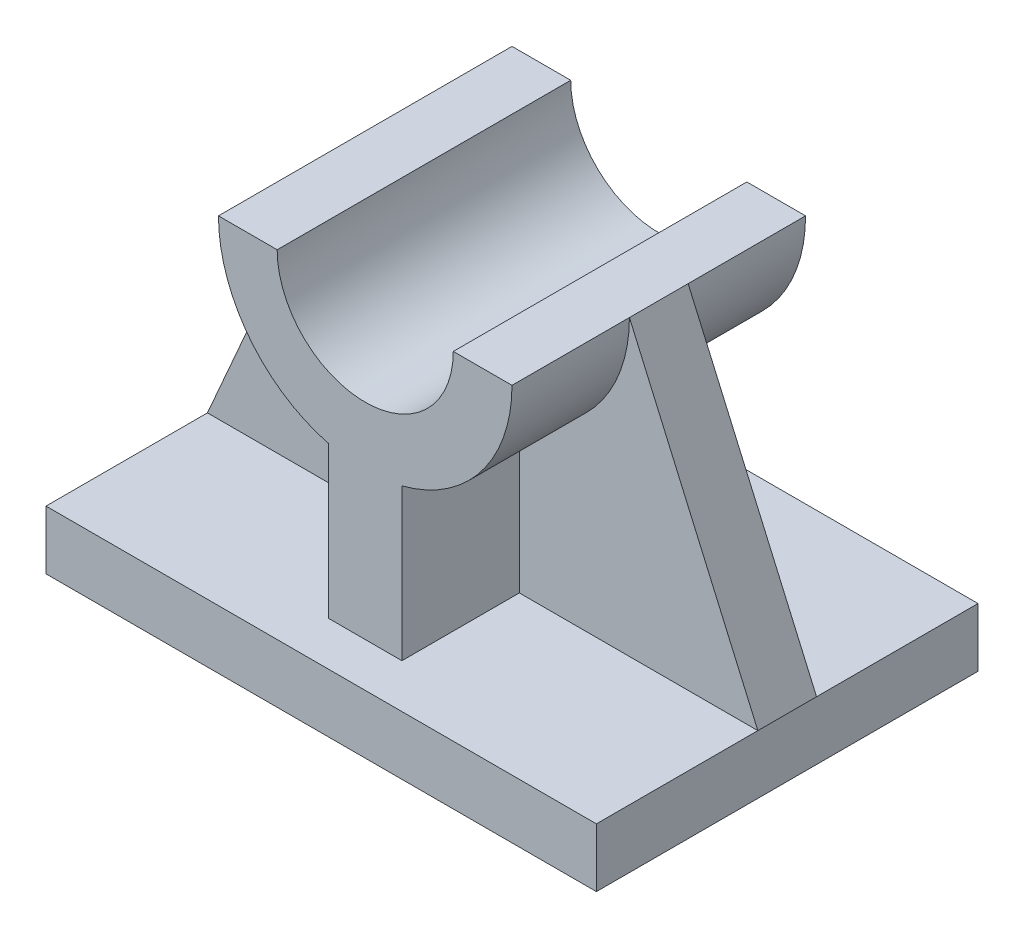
from build123d import *

# Parameters (mm, degrees)
SKETCH2_W           = 75
SKETCH2_H           = 8
BOSS_EXTRUDE1_DEPTH = 26
BOSS_EXTRUDE2_DEPTH = 20
BOSS_EXTRUDE3_DEPTH = 4


with BuildPart() as part:
    # Sketch2 → Boss-Extrude1 (new, symmetric)
    with BuildSketch(Plane.XY):
        with Locations((0, 4)):
            Rectangle(SKETCH2_W, SKETCH2_H)
        Polygon((-37.5, 8), (-37.5, 0), (0, 0), (0, 8), (-5, 8), align=None)
    extrude(amount=BOSS_EXTRUDE1_DEPTH, both=True)

    # Sketch2_3 → Boss-Extrude2 (add, symmetric)
    with BuildSketch(Plane.XY):
        with BuildLine():
            Line((-5, 28.635083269), (-5, 8))
            Line((-5, 8), (5, 8))
            Line((5, 8), (5, 28.635083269))
            ThreePointArc((5, 28.635083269), (15.811388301, 35.752551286), (20, 48))
            Line((20, 48), (12, 48))
            ThreePointArc((12, 48), (0, 36), (-12, 48))
            Line((-12, 48), (-20, 48))
            ThreePointArc((-20, 48), (-15.811388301, 35.752551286), (-5, 28.635083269))
        make_face()
    extrude(amount=BOSS_EXTRUDE2_DEPTH, both=True)

    # Sketch2_4 → Boss-Extrude3 (add, symmetric)
    with BuildSketch(Plane.XY):
        with BuildLine():
            Line((5, 8), (37.5, 8))
            Line((37.5, 8), (20, 48))
            ThreePointArc((20, 48), (15.811388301, 35.752551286), (5, 28.635083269))
            Line((5, 28.635083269), (5, 8))
        make_face()
        with BuildLine():
            Line((-20, 48), (-37.5, 8))
            Line((-37.5, 8), (-5, 8))
            Line((-5, 8), (-5, 28.635083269))
            ThreePointArc((-5, 28.635083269), (-15.811388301, 35.752551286), (-20, 48))
        make_face()
    extrude(amount=BOSS_EXTRUDE3_DEPTH, both=True)


solid = part.part
